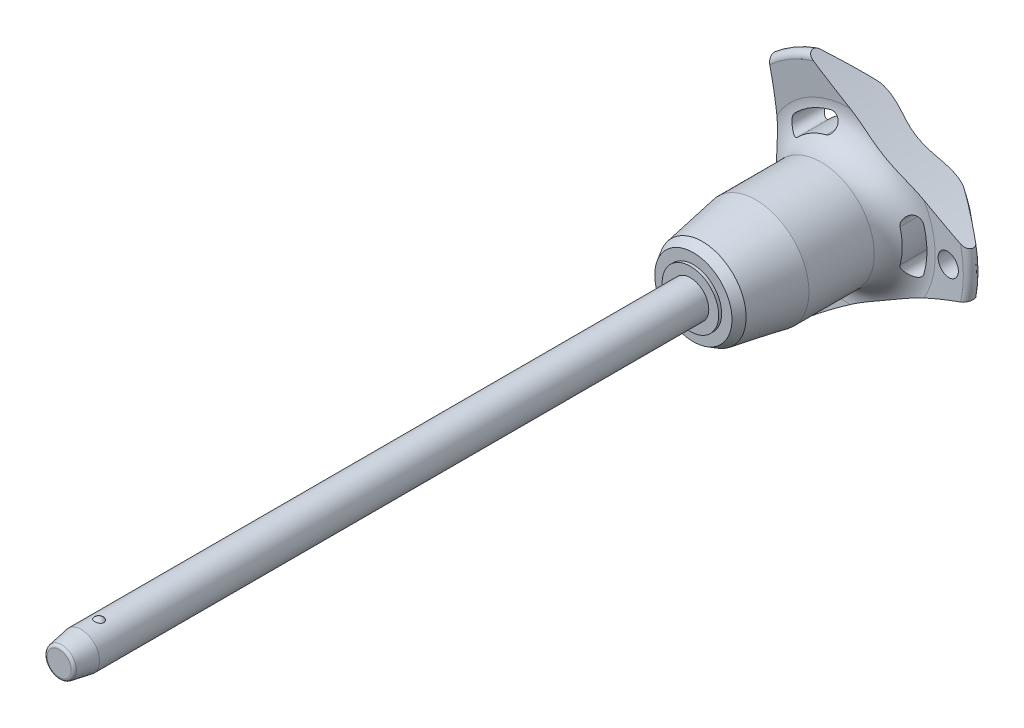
from build123d import *

# Parameters (mm, degrees)
SKETCH1_R           = 2.5
BOSS_EXTRUDE1_DEPTH = 80
SKETCH2_R           = 2.1
BOSS_EXTRUDE2_DEPTH = 26.7
BOSS_EXTRUDE3_START = 6
SKETCH1_2_R         = 2.5
BOSS_EXTRUDE3_DEPTH = 6
CHAMFER1_SIZE       = 3
CHAMFER1_SIZE2      = 0.528980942
FILLET1_R           = 0.4
SKETCH6_R           = 79.96
CUT_EXTRUDE1_DEPTH  = 110.252773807
CIRPATTERN1_COUNT   = 3
SKETCH7_R           = 1.5
CUT_EXTRUDE2_DEPTH  = 110.113366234


with BuildPart() as part:
    # Sketch1 → Boss-Extrude1 (new body)
    with BuildSketch(Plane.XY):
        Circle(SKETCH1_R)
    extrude(amount=-BOSS_EXTRUDE1_DEPTH)

    # Sketch2 → Boss-Extrude2 (add)
    with BuildSketch(Plane(origin=(0, 0, -80), x_dir=(-1, 0, 0), z_dir=(0, 0, -1))):
        Circle(SKETCH2_R)
    extrude(amount=BOSS_EXTRUDE2_DEPTH)

    # Sketch3 → Revolve1 (revolve)
    with BuildSketch(Plane(origin=(0, 0, 0), x_dir=(0, 0, -1), z_dir=(1, 0, 0))):
        with BuildLine():
            Line((-0.580947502, 2.75), (-0.580947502, 1.15))
            ThreePointArc((-0.580947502, 1.15), (0.219052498, 1.95), (-0.580947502, 2.75))
        make_face()
        with BuildLine():
            Line((-0.580947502, -1.15), (-0.580947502, -2.75))
            ThreePointArc((-0.580947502, -2.75), (0.219052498, -1.95), (-0.580947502, -1.15))
        make_face()
    revolve(axis=Axis((0, -1.15, 0.580947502), (0, 1, 0)))

    # Sketch1_2 → Boss-Extrude3 (add)
    with BuildSketch(Plane.XY.offset(BOSS_EXTRUDE3_START)):
        Circle(SKETCH1_2_R)
    extrude(amount=-BOSS_EXTRUDE3_DEPTH)

    # Chamfer1
    chamfer1_edges = [part.edges().sort_by_distance(p)[0] for p in [
        (-2.5, 0, 6),
    ]]
    chamfer1_side = [part.faces().sort_by_distance(p)[0] for p in [
        (-2.5, 0, -37),
    ]]
    chamfer(chamfer1_edges, length=CHAMFER1_SIZE, length2=CHAMFER1_SIZE2, reference=chamfer1_side[0])

    # Fillet1
    fillet1_edges = [part.edges().sort_by_distance(p)[0] for p in [
        (-1.971019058, 0, 6),
        (2.1, 0, -106.7),
    ]]
    fillet(fillet1_edges, radius=FILLET1_R)

    # Sketch4 → Revolve2 (revolve)
    with BuildSketch(Plane(origin=(0, 0, 0), x_dir=(0, 0, -1), z_dir=(1, 0, 0)), mode=Mode.PRIVATE) as revolve2_sk:
        Polygon((80, 0), (80, 3.851837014), (80.4, 3.851837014), (80.4, 5.26161122), (81.620900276, 5.966498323), (88.9, 7.25), (97.8, 7.25), (97.8, 0), align=None)
    revolve(revolve2_sk.sketch.rotate(Axis((0, 0, -97.8), (0, 0, 1)), 90), axis=Axis((0, 0, -97.8), (0, 0, 1)))

    # Sketch5 → Revolve3 (revolve)
    with BuildSketch(Plane(origin=(0, 0, 0), x_dir=(0, 0, -1), z_dir=(1, 0, 0)), mode=Mode.PRIVATE) as revolve3_sk:
        with BuildLine():
            Line((101.78715932, 11.570250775), (101.452568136, 15.735949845))
            ThreePointArc((101.452568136, 15.735949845), (101.946485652, 16.540188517), (102.862835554, 16.314230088))
            Line((102.862835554, 16.314230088), (106.326414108, 12.186497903))
            ThreePointArc((106.326414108, 12.186497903), (106.7, 11.109282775), (106.261488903, 10.056825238))
            ThreePointArc((106.261488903, 10.056825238), (103.289873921, 5.413681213), (102.25, 0))
            Line((102.25, 0), (97.8, 0))
            Line((97.8, 0), (97.8, 7.25))
            ThreePointArc((97.8, 7.25), (100.739473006, 8.537160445), (101.78715932, 11.570250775))
        make_face()
    revolve(revolve3_sk.sketch.rotate(Axis((0, 0, -102.25), (0, 0, 1)), 90), axis=Axis((0, 0, -102.25), (0, 0, 1)))

    # Sketch6 → Cut-Extrude1 (cut, through all)
    with BuildSketch(Plane.XY):
        with Locations((-89.76, 0)):
            Circle(SKETCH6_R)
        with BuildLine():
            ThreePointArc((10.099921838, -2.834717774), (10.490188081, 0), (10.099921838, 2.834717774))
            ThreePointArc((10.099921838, 2.834717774), (8.768180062, 3.582738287), (8.020159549, 2.250996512))
            ThreePointArc((8.020159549, 2.250996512), (8.330062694, 0), (8.020159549, -2.250996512))
            ThreePointArc((8.020159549, -2.250996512), (8.768180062, -3.582738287), (10.099921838, -2.834717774))
        make_face()
    cut_extrude1 = extrude(amount=-CUT_EXTRUDE1_DEPTH, mode=Mode.SUBTRACT)

    # CirPattern1: Cut-Extrude1 ×3 about axis
    cirpattern1_axis = Axis((0, 0, 0), (0, 0, 1))
    for i in range(1, CIRPATTERN1_COUNT):
        add(cut_extrude1.rotate(cirpattern1_axis, i * 360 / CIRPATTERN1_COUNT), mode=Mode.SUBTRACT)

    # Sketch7 → Cut-Extrude2 (cut, through all)
    with BuildSketch(Plane.XY):
        with Locations(Location((13.490188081, 0, 0), (0, 0, 225.221865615))):
            Circle(SKETCH7_R)
    extrude(amount=-CUT_EXTRUDE2_DEPTH, mode=Mode.SUBTRACT)


solid = part.part
